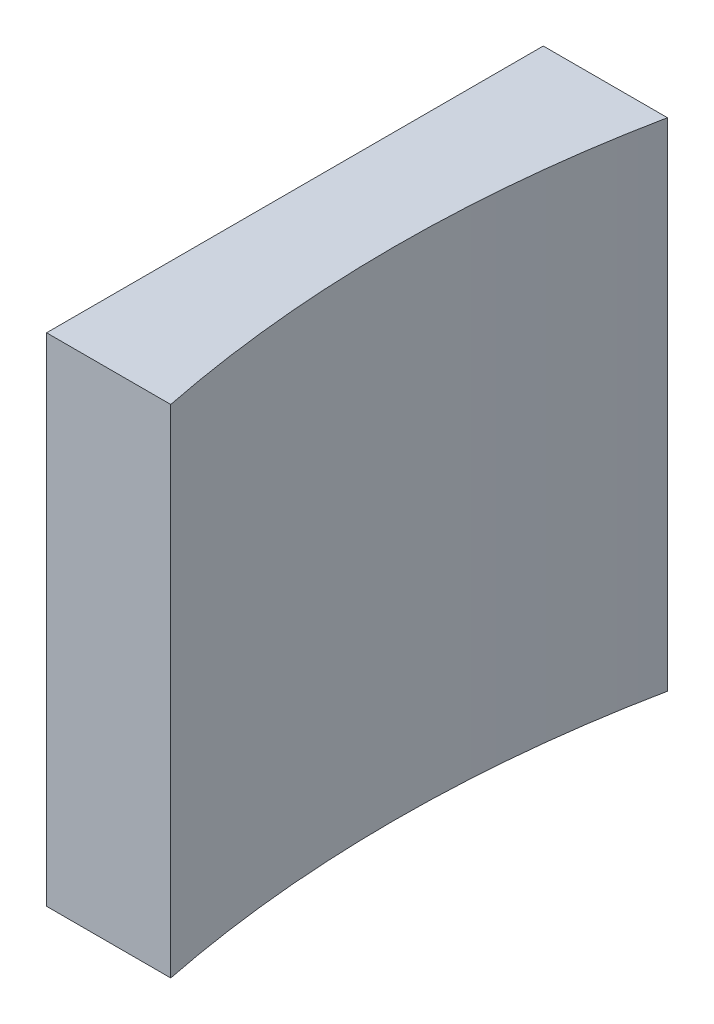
from build123d import *

# Parameters (mm, degrees)
LINEAR_AUSTRAGEN1_DEPTH = 200


with BuildPart() as part:
    # Skizze1 → Linear austragen1 (new body)
    with BuildSketch(Plane(origin=(0, 0, 0), x_dir=(1, 0, 0), z_dir=(0, 1, 0))):
        with BuildLine():
            Line((-50, 100), (-50, -100))
            Line((-50, -100), (0, -100))
            ThreePointArc((0, -100), (-10, 0), (0, 100))
            Line((0, 100), (-50, 100))
        make_face()
    extrude(amount=LINEAR_AUSTRAGEN1_DEPTH)


solid = part.part
